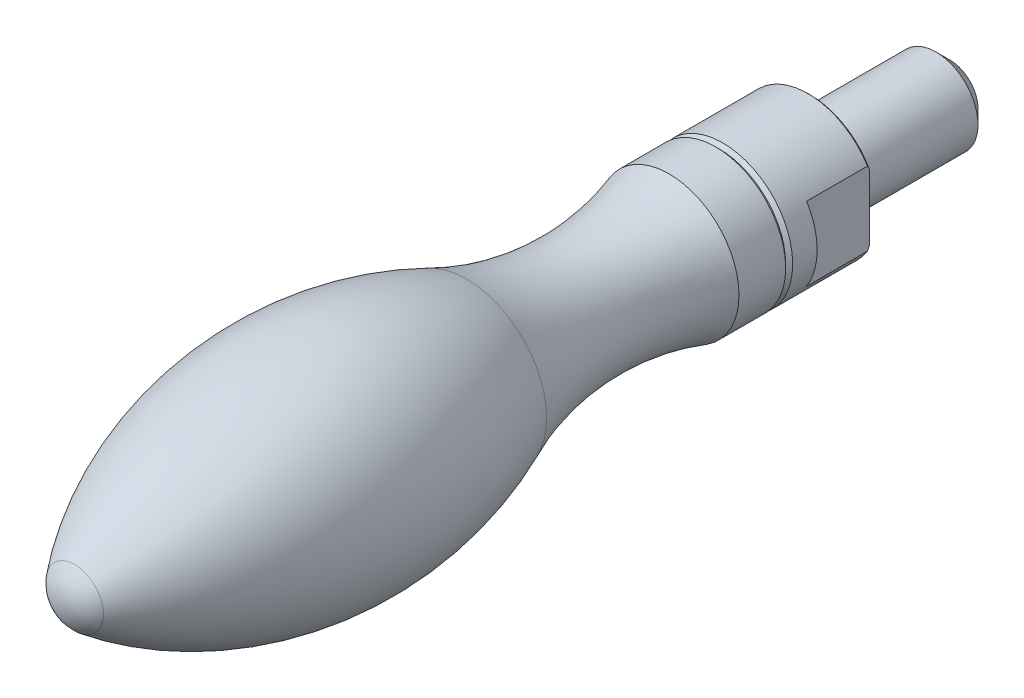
ISO-10303-21;
HEADER;
FILE_DESCRIPTION(('STEP AP214'),'2;1');
FILE_NAME('part.step','',(''),(''),'','','');
FILE_SCHEMA(('AUTOMOTIVE_DESIGN { 1 0 10303 214 1 1 1 1 }'));
ENDSEC;
DATA;
#1=APPLICATION_CONTEXT('core data for automotive mechanical design processes');
#2=APPLICATION_PROTOCOL_DEFINITION('international standard','automotive_design',2000,#1);
#3=PRODUCT_CONTEXT('',#1,'mechanical');
#4=PRODUCT('Part','Part','',(#3));
#5=PRODUCT_RELATED_PRODUCT_CATEGORY('part','',(#4));
#6=PRODUCT_DEFINITION_FORMATION('','',#4);
#7=PRODUCT_DEFINITION_CONTEXT('part definition',#1,'design');
#8=PRODUCT_DEFINITION('design','',#6,#7);
#9=PRODUCT_DEFINITION_SHAPE('','',#8);
#10=(LENGTH_UNIT() NAMED_UNIT(*) SI_UNIT(.MILLI.,.METRE.));
#11=(NAMED_UNIT(*) PLANE_ANGLE_UNIT() SI_UNIT($,.RADIAN.));
#12=(NAMED_UNIT(*) SI_UNIT($,.STERADIAN.) SOLID_ANGLE_UNIT());
#13=UNCERTAINTY_MEASURE_WITH_UNIT(LENGTH_MEASURE(1.E-05),#10,'distance_accuracy_value','');
#14=(GEOMETRIC_REPRESENTATION_CONTEXT(3) GLOBAL_UNCERTAINTY_ASSIGNED_CONTEXT((#13)) GLOBAL_UNIT_ASSIGNED_CONTEXT((#10,
#11,#12)) REPRESENTATION_CONTEXT('',''));
#15=CARTESIAN_POINT('',(0.,0.,0.));
#16=DIRECTION('',(0.,0.,1.));
#17=DIRECTION('',(1.,0.,0.));
#18=AXIS2_PLACEMENT_3D('',#15,#16,#17);
#19=CARTESIAN_POINT('',(0.,0.,-25.0000000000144));
#20=DIRECTION('',(0.,0.,-1.));
#21=DIRECTION('',(1.,0.,0.));
#22=AXIS2_PLACEMENT_3D('',#19,#20,#21);
#23=CYLINDRICAL_SURFACE('',#22,10.);
#24=CARTESIAN_POINT('',(0.,0.,12.5));
#25=DIRECTION('',(0.,0.,-1.));
#26=DIRECTION('',(1.,0.,0.));
#27=AXIS2_PLACEMENT_3D('',#24,#25,#26);
#28=CIRCLE('',#27,10.);
#29=CARTESIAN_POINT('',(10.,0.,12.5));
#30=VERTEX_POINT('',#29);
#31=EDGE_CURVE('E119',#30,#30,#28,.T.);
#32=ORIENTED_EDGE('',*,*,#31,.T.);
#33=EDGE_LOOP('',(#32));
#34=FACE_BOUND('',#33,.T.);
#35=CARTESIAN_POINT('',(0.,0.,0.299999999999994));
#36=DIRECTION('',(0.,0.,-1.));
#37=DIRECTION('',(1.,0.,0.));
#38=AXIS2_PLACEMENT_3D('',#35,#36,#37);
#39=CIRCLE('',#38,10.);
#40=CARTESIAN_POINT('',(8.5,-5.26782687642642,0.299999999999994));
#41=VERTEX_POINT('',#40);
#42=CARTESIAN_POINT('',(-8.5,-5.26782687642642,0.299999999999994));
#43=VERTEX_POINT('',#42);
#44=EDGE_CURVE('E124',#41,#43,#39,.T.);
#45=ORIENTED_EDGE('',*,*,#44,.F.);
#46=DIRECTION('',(0.,0.,-1.));
#47=VECTOR('',#46,1.);
#48=CARTESIAN_POINT('',(8.5,-5.2678268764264,-25.0000000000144));
#49=LINE('',#48,#47);
#50=CARTESIAN_POINT('',(8.5,-5.26782687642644,9.));
#51=VERTEX_POINT('',#50);
#52=EDGE_CURVE('E78',#41,#51,#49,.F.);
#53=ORIENTED_EDGE('',*,*,#52,.T.);
#54=CARTESIAN_POINT('',(0.,0.,9.));
#55=DIRECTION('',(0.,0.,1.));
#56=DIRECTION('',(0.,1.,0.));
#57=AXIS2_PLACEMENT_3D('',#54,#55,#56);
#58=CIRCLE('',#57,10.);
#59=CARTESIAN_POINT('',(8.5,5.26782687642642,9.));
#60=VERTEX_POINT('',#59);
#61=EDGE_CURVE('E82',#60,#51,#58,.F.);
#62=ORIENTED_EDGE('',*,*,#61,.F.);
#63=DIRECTION('',(0.,0.,-1.));
#64=VECTOR('',#63,1.);
#65=CARTESIAN_POINT('',(8.5,5.26782687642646,-25.0000000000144));
#66=LINE('',#65,#64);
#67=CARTESIAN_POINT('',(8.5,5.26782687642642,0.299999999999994));
#68=VERTEX_POINT('',#67);
#69=EDGE_CURVE('E67',#60,#68,#66,.T.);
#70=ORIENTED_EDGE('',*,*,#69,.T.);
#71=CARTESIAN_POINT('',(-8.5,5.26782687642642,0.299999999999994));
#72=VERTEX_POINT('',#71);
#73=EDGE_CURVE('E122',#72,#68,#39,.T.);
#74=ORIENTED_EDGE('',*,*,#73,.F.);
#75=DIRECTION('',(0.,0.,-1.));
#76=VECTOR('',#75,1.);
#77=CARTESIAN_POINT('',(-8.5,5.26782687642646,-25.0000000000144));
#78=LINE('',#77,#76);
#79=CARTESIAN_POINT('',(-8.5,5.26782687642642,9.));
#80=VERTEX_POINT('',#79);
#81=EDGE_CURVE('E134',#80,#72,#78,.T.);
#82=ORIENTED_EDGE('',*,*,#81,.F.);
#83=CARTESIAN_POINT('',(0.,0.,9.));
#84=DIRECTION('',(0.,0.,-1.));
#85=DIRECTION('',(0.,-1.,0.));
#86=AXIS2_PLACEMENT_3D('',#83,#84,#85);
#87=CIRCLE('',#86,10.);
#88=CARTESIAN_POINT('',(-8.5,-5.26782687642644,9.));
#89=VERTEX_POINT('',#88);
#90=EDGE_CURVE('E88',#80,#89,#87,.F.);
#91=ORIENTED_EDGE('',*,*,#90,.T.);
#92=DIRECTION('',(0.,0.,-1.));
#93=VECTOR('',#92,1.);
#94=CARTESIAN_POINT('',(-8.5,-5.2678268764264,-25.0000000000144));
#95=LINE('',#94,#93);
#96=EDGE_CURVE('E132',#43,#89,#95,.F.);
#97=ORIENTED_EDGE('',*,*,#96,.F.);
#98=EDGE_LOOP('',(#45,#53,#62,#70,#74,#82,#91,#97));
#99=FACE_BOUND('',#98,.T.);
#100=ADVANCED_FACE('F14',(#34,#99),#23,.T.);
#101=CARTESIAN_POINT('',(0.,0.,0.299999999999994));
#102=DIRECTION('',(0.,0.,1.));
#103=DIRECTION('',(-1.,0.,0.));
#104=AXIS2_PLACEMENT_3D('',#101,#102,#103);
#105=CONICAL_SURFACE('',#104,10.,0.785398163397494);
#106=CARTESIAN_POINT('',(8.5,2.56867166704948,-0.820356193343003));
#107=CARTESIAN_POINT('',(8.5,2.75838064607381,-0.76547544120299));
#108=CARTESIAN_POINT('',(8.5,2.9465455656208,-0.705474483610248));
#109=CARTESIAN_POINT('',(8.5,3.31963410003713,-0.576440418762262));
#110=CARTESIAN_POINT('',(8.5,3.50455961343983,-0.507412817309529));
#111=CARTESIAN_POINT('',(8.5,3.87068532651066,-0.361687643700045));
#112=CARTESIAN_POINT('',(8.5,4.05189519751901,-0.285014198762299));
#113=CARTESIAN_POINT('',(8.5,4.41129219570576,-0.12484254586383));
#114=CARTESIAN_POINT('',(8.5,4.58947880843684,-0.0413431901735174));
#115=CARTESIAN_POINT('',(8.5,5.11714030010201,0.216714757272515));
#116=CARTESIAN_POINT('',(8.5,5.4624000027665,0.399931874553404));
#117=CARTESIAN_POINT('',(8.5,5.97296463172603,0.687811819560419));
#118=CARTESIAN_POINT('',(8.5,6.14201017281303,0.785997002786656));
#119=CARTESIAN_POINT('',(8.5,6.4778456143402,0.986172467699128));
#120=CARTESIAN_POINT('',(8.5,6.64463547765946,1.08816281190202));
#121=CARTESIAN_POINT('',(8.5,7.03507901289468,1.3322970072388));
#122=CARTESIAN_POINT('',(8.5,7.25786593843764,1.47582435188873));
#123=CARTESIAN_POINT('',(8.5,7.70009623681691,1.76795255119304));
#124=CARTESIAN_POINT('',(8.5,7.91953941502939,1.91655369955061));
#125=CARTESIAN_POINT('',(8.5,8.35552106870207,2.21805047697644));
#126=CARTESIAN_POINT('',(8.5,8.57205889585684,2.37094704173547));
#127=CARTESIAN_POINT('',(8.5,9.00253635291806,2.68035963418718));
#128=CARTESIAN_POINT('',(8.5,9.21647590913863,2.83687576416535));
#129=CARTESIAN_POINT('',(8.5,9.85528209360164,3.31133974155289));
#130=CARTESIAN_POINT('',(8.5,10.2767167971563,3.63391005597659));
#131=CARTESIAN_POINT('',(8.5,11.1124438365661,4.2881724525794));
#132=CARTESIAN_POINT('',(8.5,11.5267357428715,4.61986508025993));
#133=CARTESIAN_POINT('',(8.5,12.148266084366,5.12617959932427));
#134=CARTESIAN_POINT('',(8.5,12.3576088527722,5.29822775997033));
#135=CARTESIAN_POINT('',(8.5,12.77495932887,5.64392086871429));
#136=CARTESIAN_POINT('',(8.5,12.9829670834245,5.81756576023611));
#137=CARTESIAN_POINT('',(8.5,13.6052392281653,6.34063468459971));
#138=CARTESIAN_POINT('',(8.5,14.0177275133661,6.69217253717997));
#139=CARTESIAN_POINT('',(8.5,14.8374371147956,7.39843100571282));
#140=CARTESIAN_POINT('',(8.5,15.2446718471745,7.75313609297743));
#141=CARTESIAN_POINT('',(8.5,16.0559512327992,8.46608631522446));
#142=CARTESIAN_POINT('',(8.5,16.4599962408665,8.82433104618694));
#143=CARTESIAN_POINT('',(8.5,16.8627957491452,9.1839582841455));
#144=B_SPLINE_CURVE_WITH_KNOTS('',3,(#106,#107,#108,#109,#110,#111,#112,#113,#114,#115,#116,
#117,#118,#119,#120,#121,#122,#123,#124,#125,#126,#127,#128,#129,#130,#131,#132,#133,#134,#135,
#136,#137,#138,#139,#140,#141,#142,#143),.UNSPECIFIED.,.F.,.F.,(4,2,2,2,2,2,2,2,2,2,2,2,2,2,2,2,
2,2,4),(0.,0.592302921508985,1.18424623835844,1.77437742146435,2.36460803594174,3.5363898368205,
4.12283527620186,4.70929035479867,5.50425762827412,6.29927099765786,7.09445891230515,
7.88966932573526,9.48162463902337,11.0736753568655,11.8865796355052,12.699455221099,
14.3253032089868,15.9454369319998,17.565387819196),.UNSPECIFIED.);
#145=CARTESIAN_POINT('',(8.5,4.67332857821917,0.));
#146=VERTEX_POINT('',#145);
#147=EDGE_CURVE('E73',#146,#68,#144,.T.);
#148=ORIENTED_EDGE('',*,*,#147,.F.);
#149=CARTESIAN_POINT('',(0.,0.,0.));
#150=DIRECTION('',(0.,0.,-1.));
#151=DIRECTION('',(1.,0.,0.));
#152=AXIS2_PLACEMENT_3D('',#149,#150,#151);
#153=CIRCLE('',#152,9.7);
#154=CARTESIAN_POINT('',(-8.5,4.67332857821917,0.));
#155=VERTEX_POINT('',#154);
#156=EDGE_CURVE('E125',#155,#146,#153,.T.);
#157=ORIENTED_EDGE('',*,*,#156,.F.);
#158=CARTESIAN_POINT('',(-8.5,2.56867166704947,-0.820356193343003));
#159=CARTESIAN_POINT('',(-8.5,2.7583806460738,-0.765475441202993));
#160=CARTESIAN_POINT('',(-8.5,2.94654556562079,-0.705474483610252));
#161=CARTESIAN_POINT('',(-8.5,3.31963410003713,-0.576440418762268));
#162=CARTESIAN_POINT('',(-8.5,3.50455961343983,-0.507412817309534));
#163=CARTESIAN_POINT('',(-8.5,3.87068532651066,-0.36168764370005));
#164=CARTESIAN_POINT('',(-8.5,4.05189519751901,-0.285014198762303));
#165=CARTESIAN_POINT('',(-8.5,4.41129219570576,-0.124842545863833));
#166=CARTESIAN_POINT('',(-8.5,4.58947880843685,-0.0413431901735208));
#167=CARTESIAN_POINT('',(-8.5,5.11714030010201,0.216714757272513));
#168=CARTESIAN_POINT('',(-8.5,5.4624000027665,0.399931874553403));
#169=CARTESIAN_POINT('',(-8.5,5.97296463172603,0.687811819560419));
#170=CARTESIAN_POINT('',(-8.5,6.14201017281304,0.785997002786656));
#171=CARTESIAN_POINT('',(-8.5,6.47784561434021,0.986172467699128));
#172=CARTESIAN_POINT('',(-8.5,6.64463547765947,1.08816281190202));
#173=CARTESIAN_POINT('',(-8.5,7.03507901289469,1.3322970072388));
#174=CARTESIAN_POINT('',(-8.5,7.25786593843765,1.47582435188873));
#175=CARTESIAN_POINT('',(-8.5,7.70009623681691,1.76795255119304));
#176=CARTESIAN_POINT('',(-8.5,7.91953941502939,1.91655369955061));
#177=CARTESIAN_POINT('',(-8.5,8.35552106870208,2.21805047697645));
#178=CARTESIAN_POINT('',(-8.5,8.57205889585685,2.37094704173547));
#179=CARTESIAN_POINT('',(-8.5,9.00253635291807,2.68035963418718));
#180=CARTESIAN_POINT('',(-8.5,9.21647590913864,2.83687576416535));
#181=CARTESIAN_POINT('',(-8.5,9.85528209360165,3.31133974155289));
#182=CARTESIAN_POINT('',(-8.5,10.2767167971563,3.63391005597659));
#183=CARTESIAN_POINT('',(-8.5,11.1124438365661,4.2881724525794));
#184=CARTESIAN_POINT('',(-8.5,11.5267357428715,4.61986508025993));
#185=CARTESIAN_POINT('',(-8.5,12.148266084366,5.12617959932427));
#186=CARTESIAN_POINT('',(-8.5,12.3576088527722,5.29822775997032));
#187=CARTESIAN_POINT('',(-8.5,12.77495932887,5.64392086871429));
#188=CARTESIAN_POINT('',(-8.5,12.9829670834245,5.8175657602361));
#189=CARTESIAN_POINT('',(-8.5,13.6052392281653,6.34063468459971));
#190=CARTESIAN_POINT('',(-8.5,14.0177275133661,6.69217253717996));
#191=CARTESIAN_POINT('',(-8.5,14.8374371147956,7.39843100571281));
#192=CARTESIAN_POINT('',(-8.5,15.2446718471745,7.75313609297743));
#193=CARTESIAN_POINT('',(-8.5,16.0559512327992,8.46608631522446));
#194=CARTESIAN_POINT('',(-8.5,16.4599962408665,8.82433104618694));
#195=CARTESIAN_POINT('',(-8.5,16.8627957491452,9.1839582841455));
#196=B_SPLINE_CURVE_WITH_KNOTS('',3,(#158,#159,#160,#161,#162,#163,#164,#165,#166,#167,#168,
#169,#170,#171,#172,#173,#174,#175,#176,#177,#178,#179,#180,#181,#182,#183,#184,#185,#186,#187,
#188,#189,#190,#191,#192,#193,#194,#195),.UNSPECIFIED.,.F.,.F.,(4,2,2,2,2,2,2,2,2,2,2,2,2,2,2,2,
2,2,4),(0.,0.592302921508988,1.18424623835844,1.77437742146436,2.36460803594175,
3.53638983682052,4.12283527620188,4.70929035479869,5.50425762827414,6.29927099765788,
7.09445891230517,7.88966932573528,9.48162463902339,11.0736753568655,11.8865796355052,
12.699455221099,14.3253032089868,15.9454369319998,17.565387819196),.UNSPECIFIED.);
#197=EDGE_CURVE('E37',#155,#72,#196,.T.);
#198=ORIENTED_EDGE('',*,*,#197,.T.);
#199=ORIENTED_EDGE('',*,*,#73,.T.);
#200=EDGE_LOOP('',(#148,#157,#198,#199));
#201=FACE_BOUND('',#200,.T.);
#202=ADVANCED_FACE('F149',(#201),#105,.T.);
#203=CARTESIAN_POINT('',(8.5,-8.10616511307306,2.04563377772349));
#204=CARTESIAN_POINT('',(8.5,-7.89541017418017,1.90021860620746));
#205=CARTESIAN_POINT('',(8.5,-7.68328150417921,1.75675655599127));
#206=CARTESIAN_POINT('',(8.5,-7.25580100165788,1.47455330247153));
#207=CARTESIAN_POINT('',(8.5,-7.04044803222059,1.33581382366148));
#208=CARTESIAN_POINT('',(8.5,-6.60462424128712,1.06299340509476));
#209=CARTESIAN_POINT('',(8.5,-6.38412766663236,0.928953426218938));
#210=CARTESIAN_POINT('',(8.5,-5.9391115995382,0.667765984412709));
#211=CARTESIAN_POINT('',(8.5,-5.71459254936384,0.540617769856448));
#212=CARTESIAN_POINT('',(8.5,-5.26926589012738,0.299073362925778));
#213=CARTESIAN_POINT('',(8.5,-5.04862000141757,0.184381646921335));
#214=CARTESIAN_POINT('',(8.5,-4.60277091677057,-0.0357411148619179));
#215=CARTESIAN_POINT('',(8.5,-4.37756722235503,-0.141171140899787));
#216=CARTESIAN_POINT('',(8.5,-3.69577783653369,-0.440286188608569));
#217=CARTESIAN_POINT('',(8.5,-3.23157106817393,-0.617604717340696));
#218=CARTESIAN_POINT('',(8.5,-2.54851206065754,-0.828398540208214));
#219=CARTESIAN_POINT('',(8.5,-2.3372877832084,-0.886928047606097));
#220=CARTESIAN_POINT('',(8.5,-1.9114557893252,-0.990177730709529));
#221=CARTESIAN_POINT('',(8.5,-1.69684824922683,-1.03489862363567));
#222=CARTESIAN_POINT('',(8.5,-1.26167378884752,-1.10958504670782));
#223=CARTESIAN_POINT('',(8.5,-1.04106586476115,-1.13931608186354));
#224=CARTESIAN_POINT('',(8.5,-0.708852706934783,-1.17120892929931));
#225=CARTESIAN_POINT('',(8.5,-0.597830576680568,-1.17972389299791));
#226=CARTESIAN_POINT('',(8.5,-0.375528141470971,-1.19243340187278));
#227=CARTESIAN_POINT('',(8.5,-0.264247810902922,-1.19662749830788));
#228=CARTESIAN_POINT('',(8.5,-0.152915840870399,-1.19862462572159));
#229=B_SPLINE_CURVE_WITH_KNOTS('',3,(#203,#204,#205,#206,#207,#208,#209,#210,#211,#212,#213,
#214,#215,#216,#217,#218,#219,#220,#221,#222,#223,#224,#225,#226,#227,#228),.UNSPECIFIED.,.F.,
.F.,(4,2,2,2,2,2,2,2,2,2,2,2,4),(0.,0.768180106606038,1.53663777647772,2.31065454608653,
3.08458672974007,3.83038837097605,4.57627202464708,6.06309227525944,6.72027493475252,
7.37742345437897,8.04455578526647,8.37852611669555,8.71253112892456),.UNSPECIFIED.);
#230=CARTESIAN_POINT('',(8.5,-4.67332857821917,0.));
#231=VERTEX_POINT('',#230);
#232=EDGE_CURVE('E29',#41,#231,#229,.T.);
#233=ORIENTED_EDGE('',*,*,#232,.F.);
#234=ORIENTED_EDGE('',*,*,#44,.T.);
#235=CARTESIAN_POINT('',(-8.5,-8.10616511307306,2.04563377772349));
#236=CARTESIAN_POINT('',(-8.5,-7.89541017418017,1.90021860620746));
#237=CARTESIAN_POINT('',(-8.5,-7.68328150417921,1.75675655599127));
#238=CARTESIAN_POINT('',(-8.5,-7.25580100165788,1.47455330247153));
#239=CARTESIAN_POINT('',(-8.5,-7.04044803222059,1.33581382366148));
#240=CARTESIAN_POINT('',(-8.5,-6.60462424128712,1.06299340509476));
#241=CARTESIAN_POINT('',(-8.5,-6.38412766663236,0.928953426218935));
#242=CARTESIAN_POINT('',(-8.5,-5.93911159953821,0.667765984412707));
#243=CARTESIAN_POINT('',(-8.5,-5.71459254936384,0.540617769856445));
#244=CARTESIAN_POINT('',(-8.5,-5.26926589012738,0.299073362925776));
#245=CARTESIAN_POINT('',(-8.5,-5.04862000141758,0.184381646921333));
#246=CARTESIAN_POINT('',(-8.5,-4.60277091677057,-0.0357411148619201));
#247=CARTESIAN_POINT('',(-8.5,-4.37756722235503,-0.14117114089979));
#248=CARTESIAN_POINT('',(-8.5,-3.69577783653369,-0.440286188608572));
#249=CARTESIAN_POINT('',(-8.5,-3.23157106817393,-0.617604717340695));
#250=CARTESIAN_POINT('',(-8.5,-2.54851206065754,-0.828398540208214));
#251=CARTESIAN_POINT('',(-8.5,-2.3372877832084,-0.886928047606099));
#252=CARTESIAN_POINT('',(-8.5,-1.91145578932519,-0.990177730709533));
#253=CARTESIAN_POINT('',(-8.5,-1.69684824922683,-1.03489862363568));
#254=CARTESIAN_POINT('',(-8.5,-1.26167378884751,-1.10958504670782));
#255=CARTESIAN_POINT('',(-8.5,-1.04106586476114,-1.13931608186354));
#256=CARTESIAN_POINT('',(-8.5,-0.708852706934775,-1.17120892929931));
#257=CARTESIAN_POINT('',(-8.5,-0.59783057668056,-1.17972389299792));
#258=CARTESIAN_POINT('',(-8.5,-0.375528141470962,-1.19243340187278));
#259=CARTESIAN_POINT('',(-8.5,-0.264247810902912,-1.19662749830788));
#260=CARTESIAN_POINT('',(-8.5,-0.152915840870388,-1.19862462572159));
#261=B_SPLINE_CURVE_WITH_KNOTS('',3,(#235,#236,#237,#238,#239,#240,#241,#242,#243,#244,#245,
#246,#247,#248,#249,#250,#251,#252,#253,#254,#255,#256,#257,#258,#259,#260),.UNSPECIFIED.,.F.,
.F.,(4,2,2,2,2,2,2,2,2,2,2,2,4),(0.,0.768180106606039,1.53663777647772,2.31065454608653,
3.08458672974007,3.83038837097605,4.57627202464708,6.06309227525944,6.72027493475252,
7.37742345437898,8.04455578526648,8.37852611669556,8.71253112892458),.UNSPECIFIED.);
#262=CARTESIAN_POINT('',(-8.5,-4.67332857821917,0.));
#263=VERTEX_POINT('',#262);
#264=EDGE_CURVE('E143',#43,#263,#261,.T.);
#265=ORIENTED_EDGE('',*,*,#264,.T.);
#266=EDGE_CURVE('E128',#231,#263,#153,.T.);
#267=ORIENTED_EDGE('',*,*,#266,.F.);
#268=EDGE_LOOP('',(#233,#234,#265,#267));
#269=FACE_BOUND('',#268,.T.);
#270=ADVANCED_FACE('F172',(#269),#105,.T.);
#271=CARTESIAN_POINT('',(-9.70000000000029,0.,0.));
#272=DIRECTION('',(0.,0.,1.));
#273=DIRECTION('',(-1.,0.,0.));
#274=AXIS2_PLACEMENT_3D('',#271,#272,#273);
#275=PLANE('',#274);
#276=CARTESIAN_POINT('',(0.,0.,0.));
#277=DIRECTION('',(0.,0.,-1.));
#278=DIRECTION('',(1.,0.,0.));
#279=AXIS2_PLACEMENT_3D('',#276,#277,#278);
#280=CIRCLE('',#279,6.);
#281=CARTESIAN_POINT('',(6.,0.,0.));
#282=VERTEX_POINT('',#281);
#283=EDGE_CURVE('E129',#282,#282,#280,.T.);
#284=ORIENTED_EDGE('',*,*,#283,.F.);
#285=EDGE_LOOP('',(#284));
#286=FACE_BOUND('',#285,.T.);
#287=DIRECTION('',(0.,1.,0.));
#288=VECTOR('',#287,1.);
#289=CARTESIAN_POINT('',(8.5,0.,0.));
#290=LINE('',#289,#288);
#291=EDGE_CURVE('E85',#231,#146,#290,.T.);
#292=ORIENTED_EDGE('',*,*,#291,.F.);
#293=ORIENTED_EDGE('',*,*,#266,.T.);
#294=DIRECTION('',(0.,1.,0.));
#295=VECTOR('',#294,1.);
#296=CARTESIAN_POINT('',(-8.5,0.,0.));
#297=LINE('',#296,#295);
#298=EDGE_CURVE('E93',#263,#155,#297,.T.);
#299=ORIENTED_EDGE('',*,*,#298,.T.);
#300=ORIENTED_EDGE('',*,*,#156,.T.);
#301=EDGE_LOOP('',(#292,#293,#299,#300));
#302=FACE_BOUND('',#301,.T.);
#303=ADVANCED_FACE('F169',(#286,#302),#275,.F.);
#304=CARTESIAN_POINT('',(-6.,0.,-20.0000000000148));
#305=DIRECTION('',(0.,0.,1.));
#306=DIRECTION('',(-1.,0.,0.));
#307=AXIS2_PLACEMENT_3D('',#304,#305,#306);
#308=PLANE('',#307);
#309=CARTESIAN_POINT('',(0.,0.,-20.0000000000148));
#310=DIRECTION('',(0.,0.,1.));
#311=DIRECTION('',(0.,-1.,0.));
#312=AXIS2_PLACEMENT_3D('',#309,#310,#311);
#313=CIRCLE('',#312,4.);
#314=CARTESIAN_POINT('',(0.,-3.99999999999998,-20.0000000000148));
#315=VERTEX_POINT('',#314);
#316=EDGE_CURVE('E22',#315,#315,#313,.F.);
#317=ORIENTED_EDGE('',*,*,#316,.T.);
#318=EDGE_LOOP('',(#317));
#319=FACE_BOUND('',#318,.T.);
#320=ADVANCED_FACE('F171',(#319),#308,.F.);
#321=CARTESIAN_POINT('',(0.,-1.11311423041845E-13,101.5));
#322=DIRECTION('',(0.,-1.,0.));
#323=DIRECTION('',(0.,0.,1.));
#324=AXIS2_PLACEMENT_3D('',#321,#322,#323);
#325=SPHERICAL_SURFACE('',#324,5.5);
#326=CARTESIAN_POINT('',(0.,-1.11311423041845E-13,101.5));
#327=DIRECTION('',(0.,0.,-1.));
#328=DIRECTION('',(1.,0.,0.));
#329=AXIS2_PLACEMENT_3D('',#326,#327,#328);
#330=SPHERICAL_SURFACE('',#329,5.5);
#331=CARTESIAN_POINT('',(0.,-1.15322900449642E-13,105.157890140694));
#332=DIRECTION('',(0.,0.,-1.));
#333=DIRECTION('',(1.,0.,0.));
#334=AXIS2_PLACEMENT_3D('',#331,#332,#333);
#335=CIRCLE('',#334,4.10729104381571);
#336=CARTESIAN_POINT('',(4.10729104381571,-1.15322900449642E-13,105.157890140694));
#337=VERTEX_POINT('',#336);
#338=EDGE_CURVE('E95',#337,#337,#335,.T.);
#339=ORIENTED_EDGE('',*,*,#338,.F.);
#340=EDGE_LOOP('',(#339));
#341=FACE_BOUND('',#340,.T.);
#342=ADVANCED_FACE('F180',(#341),#330,.T.);
#343=CARTESIAN_POINT('',(0.,0.,71.));
#344=DIRECTION('',(0.,0.,-1.));
#345=DIRECTION('',(1.,0.,0.));
#346=AXIS2_PLACEMENT_3D('',#343,#344,#345);
#347=DEGENERATE_TOROIDAL_SURFACE('',#346,39.,55.,.F.);
#348=CARTESIAN_POINT('',(0.,0.,49.1534009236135));
#349=DIRECTION('',(0.,0.,-1.));
#350=DIRECTION('',(1.,0.,0.));
#351=AXIS2_PLACEMENT_3D('',#348,#349,#350);
#352=CIRCLE('',#351,11.475004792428);
#353=CARTESIAN_POINT('',(11.475004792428,0.,49.1534009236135));
#354=VERTEX_POINT('',#353);
#355=EDGE_CURVE('E98',#354,#354,#352,.T.);
#356=ORIENTED_EDGE('',*,*,#355,.F.);
#357=EDGE_LOOP('',(#356));
#358=FACE_BOUND('',#357,.T.);
#359=ORIENTED_EDGE('',*,*,#338,.T.);
#360=EDGE_LOOP('',(#359));
#361=FACE_BOUND('',#360,.T.);
#362=ADVANCED_FACE('F219',(#358,#361),#347,.F.);
#363=CARTESIAN_POINT('',(0.,0.,32.74));
#364=DIRECTION('',(0.,0.,-1.));
#365=DIRECTION('',(1.,0.,0.));
#366=AXIS2_PLACEMENT_3D('',#363,#364,#365);
#367=TOROIDAL_SURFACE('',#366,48.5,40.5);
#368=ORIENTED_EDGE('',*,*,#355,.T.);
#369=EDGE_LOOP('',(#368));
#370=FACE_BOUND('',#369,.T.);
#371=CARTESIAN_POINT('',(0.,0.,20.1701949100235));
#372=DIRECTION('',(0.,0.,-1.));
#373=DIRECTION('',(1.,0.,0.));
#374=AXIS2_PLACEMENT_3D('',#371,#372,#373);
#375=CIRCLE('',#374,9.99999999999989);
#376=CARTESIAN_POINT('',(9.99999999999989,0.,20.1701949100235));
#377=VERTEX_POINT('',#376);
#378=EDGE_CURVE('E101',#377,#377,#375,.T.);
#379=ORIENTED_EDGE('',*,*,#378,.F.);
#380=EDGE_LOOP('',(#379));
#381=FACE_BOUND('',#380,.T.);
#382=ADVANCED_FACE('F215',(#370,#381),#367,.F.);
#383=CARTESIAN_POINT('',(0.,0.,-25.0000000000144));
#384=DIRECTION('',(0.,0.,-1.));
#385=DIRECTION('',(1.,0.,0.));
#386=AXIS2_PLACEMENT_3D('',#383,#384,#385);
#387=CYLINDRICAL_SURFACE('',#386,10.);
#388=ORIENTED_EDGE('',*,*,#378,.T.);
#389=EDGE_LOOP('',(#388));
#390=FACE_BOUND('',#389,.T.);
#391=CARTESIAN_POINT('',(0.,0.,13.5));
#392=DIRECTION('',(0.,0.,-1.));
#393=DIRECTION('',(1.,0.,0.));
#394=AXIS2_PLACEMENT_3D('',#391,#392,#393);
#395=CIRCLE('',#394,10.);
#396=CARTESIAN_POINT('',(10.,0.,13.5));
#397=VERTEX_POINT('',#396);
#398=EDGE_CURVE('E104',#397,#397,#395,.T.);
#399=ORIENTED_EDGE('',*,*,#398,.F.);
#400=EDGE_LOOP('',(#399));
#401=FACE_BOUND('',#400,.T.);
#402=ADVANCED_FACE('F211',(#390,#401),#387,.T.);
#403=CARTESIAN_POINT('',(-10.0000000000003,0.,13.5));
#404=DIRECTION('',(0.,0.,1.));
#405=DIRECTION('',(-1.,0.,0.));
#406=AXIS2_PLACEMENT_3D('',#403,#404,#405);
#407=PLANE('',#406);
#408=CARTESIAN_POINT('',(0.,0.,13.5));
#409=DIRECTION('',(0.,0.,-1.));
#410=DIRECTION('',(1.,0.,0.));
#411=AXIS2_PLACEMENT_3D('',#408,#409,#410);
#412=CIRCLE('',#411,4.95000000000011);
#413=CARTESIAN_POINT('',(4.95000000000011,0.,13.5));
#414=VERTEX_POINT('',#413);
#415=EDGE_CURVE('E107',#414,#414,#412,.T.);
#416=ORIENTED_EDGE('',*,*,#415,.F.);
#417=EDGE_LOOP('',(#416));
#418=FACE_BOUND('',#417,.T.);
#419=ORIENTED_EDGE('',*,*,#398,.T.);
#420=EDGE_LOOP('',(#419));
#421=FACE_BOUND('',#420,.T.);
#422=ADVANCED_FACE('F207',(#418,#421),#407,.F.);
#423=CARTESIAN_POINT('',(0.,0.,-25.0000000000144));
#424=DIRECTION('',(0.,0.,-1.));
#425=DIRECTION('',(1.,0.,0.));
#426=AXIS2_PLACEMENT_3D('',#423,#424,#425);
#427=CYLINDRICAL_SURFACE('',#426,4.95000000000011);
#428=ORIENTED_EDGE('',*,*,#415,.T.);
#429=EDGE_LOOP('',(#428));
#430=FACE_BOUND('',#429,.T.);
#431=CARTESIAN_POINT('',(0.,0.,13.4));
#432=DIRECTION('',(0.,0.,-1.));
#433=DIRECTION('',(1.,0.,0.));
#434=AXIS2_PLACEMENT_3D('',#431,#432,#433);
#435=CIRCLE('',#434,4.95000000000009);
#436=CARTESIAN_POINT('',(4.95000000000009,0.,13.4));
#437=VERTEX_POINT('',#436);
#438=EDGE_CURVE('E110',#437,#437,#435,.T.);
#439=ORIENTED_EDGE('',*,*,#438,.F.);
#440=EDGE_LOOP('',(#439));
#441=FACE_BOUND('',#440,.T.);
#442=ADVANCED_FACE('F203',(#430,#441),#427,.T.);
#443=CARTESIAN_POINT('',(0.,0.,13.4));
#444=DIRECTION('',(0.,0.,-1.));
#445=DIRECTION('',(1.,0.,0.));
#446=AXIS2_PLACEMENT_3D('',#443,#444,#445);
#447=TOROIDAL_SURFACE('',#446,5.35000000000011,0.400000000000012);
#448=ORIENTED_EDGE('',*,*,#438,.T.);
#449=EDGE_LOOP('',(#448));
#450=FACE_BOUND('',#449,.T.);
#451=CARTESIAN_POINT('',(0.,0.,13.));
#452=DIRECTION('',(0.,0.,-1.));
#453=DIRECTION('',(1.,0.,0.));
#454=AXIS2_PLACEMENT_3D('',#451,#452,#453);
#455=CIRCLE('',#454,5.3500000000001);
#456=CARTESIAN_POINT('',(5.3500000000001,0.,13.));
#457=VERTEX_POINT('',#456);
#458=EDGE_CURVE('E113',#457,#457,#455,.T.);
#459=ORIENTED_EDGE('',*,*,#458,.F.);
#460=EDGE_LOOP('',(#459));
#461=FACE_BOUND('',#460,.T.);
#462=ADVANCED_FACE('F199',(#450,#461),#447,.F.);
#463=CARTESIAN_POINT('',(-9.50000000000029,0.,13.));
#464=DIRECTION('',(0.,0.,1.));
#465=DIRECTION('',(-1.,0.,0.));
#466=AXIS2_PLACEMENT_3D('',#463,#464,#465);
#467=PLANE('',#466);
#468=ORIENTED_EDGE('',*,*,#458,.T.);
#469=EDGE_LOOP('',(#468));
#470=FACE_BOUND('',#469,.T.);
#471=CARTESIAN_POINT('',(0.,0.,13.));
#472=DIRECTION('',(0.,0.,-1.));
#473=DIRECTION('',(1.,0.,0.));
#474=AXIS2_PLACEMENT_3D('',#471,#472,#473);
#475=CIRCLE('',#474,9.5);
#476=CARTESIAN_POINT('',(9.5,0.,13.));
#477=VERTEX_POINT('',#476);
#478=EDGE_CURVE('E116',#477,#477,#475,.T.);
#479=ORIENTED_EDGE('',*,*,#478,.F.);
#480=EDGE_LOOP('',(#479));
#481=FACE_BOUND('',#480,.T.);
#482=ADVANCED_FACE('F195',(#470,#481),#467,.T.);
#483=CARTESIAN_POINT('',(0.,0.,12.5));
#484=DIRECTION('',(0.,0.,-1.));
#485=DIRECTION('',(1.,0.,0.));
#486=AXIS2_PLACEMENT_3D('',#483,#484,#485);
#487=CONICAL_SURFACE('',#486,10.,0.785398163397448);
#488=ORIENTED_EDGE('',*,*,#478,.T.);
#489=EDGE_LOOP('',(#488));
#490=FACE_BOUND('',#489,.T.);
#491=ORIENTED_EDGE('',*,*,#31,.F.);
#492=EDGE_LOOP('',(#491));
#493=FACE_BOUND('',#492,.T.);
#494=ADVANCED_FACE('F167',(#490,#493),#487,.T.);
#495=CARTESIAN_POINT('',(0.,0.,-25.0000000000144));
#496=DIRECTION('',(0.,0.,-1.));
#497=DIRECTION('',(1.,0.,0.));
#498=AXIS2_PLACEMENT_3D('',#495,#496,#497);
#499=CYLINDRICAL_SURFACE('',#498,6.);
#500=CARTESIAN_POINT('',(0.,0.,-18.0000000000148));
#501=DIRECTION('',(0.,0.,1.));
#502=DIRECTION('',(0.,-1.,0.));
#503=AXIS2_PLACEMENT_3D('',#500,#501,#502);
#504=CIRCLE('',#503,6.);
#505=CARTESIAN_POINT('',(0.,-5.99999999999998,-18.0000000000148));
#506=VERTEX_POINT('',#505);
#507=EDGE_CURVE('E9',#506,#506,#504,.T.);
#508=ORIENTED_EDGE('',*,*,#507,.T.);
#509=EDGE_LOOP('',(#508));
#510=FACE_BOUND('',#509,.T.);
#511=ORIENTED_EDGE('',*,*,#283,.T.);
#512=EDGE_LOOP('',(#511));
#513=FACE_BOUND('',#512,.T.);
#514=ADVANCED_FACE('F164',(#510,#513),#499,.T.);
#515=CARTESIAN_POINT('',(-13.1597927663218,10.,9.));
#516=DIRECTION('',(0.,0.,-1.));
#517=DIRECTION('',(0.,-1.,0.));
#518=AXIS2_PLACEMENT_3D('',#515,#516,#517);
#519=PLANE('',#518);
#520=DIRECTION('',(0.,-1.,0.));
#521=VECTOR('',#520,1.);
#522=CARTESIAN_POINT('',(-8.5,10.,9.));
#523=LINE('',#522,#521);
#524=EDGE_CURVE('E378',#80,#89,#523,.T.);
#525=ORIENTED_EDGE('',*,*,#524,.T.);
#526=ORIENTED_EDGE('',*,*,#90,.F.);
#527=EDGE_LOOP('',(#525,#526));
#528=FACE_BOUND('',#527,.T.);
#529=ADVANCED_FACE('F158',(#528),#519,.T.);
#530=CARTESIAN_POINT('',(-8.5,10.,-3.64558421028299));
#531=DIRECTION('',(1.,0.,0.));
#532=DIRECTION('',(0.,1.,0.));
#533=AXIS2_PLACEMENT_3D('',#530,#531,#532);
#534=PLANE('',#533);
#535=ORIENTED_EDGE('',*,*,#96,.T.);
#536=ORIENTED_EDGE('',*,*,#524,.F.);
#537=ORIENTED_EDGE('',*,*,#81,.T.);
#538=ORIENTED_EDGE('',*,*,#197,.F.);
#539=ORIENTED_EDGE('',*,*,#298,.F.);
#540=ORIENTED_EDGE('',*,*,#264,.F.);
#541=EDGE_LOOP('',(#535,#536,#537,#538,#539,#540));
#542=FACE_BOUND('',#541,.T.);
#543=ADVANCED_FACE('F153',(#542),#534,.F.);
#544=CARTESIAN_POINT('',(8.5,10.,-3.64558421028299));
#545=DIRECTION('',(1.,0.,0.));
#546=DIRECTION('',(0.,1.,0.));
#547=AXIS2_PLACEMENT_3D('',#544,#545,#546);
#548=PLANE('',#547);
#549=ORIENTED_EDGE('',*,*,#232,.T.);
#550=ORIENTED_EDGE('',*,*,#291,.T.);
#551=ORIENTED_EDGE('',*,*,#147,.T.);
#552=ORIENTED_EDGE('',*,*,#69,.F.);
#553=DIRECTION('',(0.,-1.,0.));
#554=VECTOR('',#553,1.);
#555=CARTESIAN_POINT('',(8.5,10.,9.));
#556=LINE('',#555,#554);
#557=EDGE_CURVE('E70',#60,#51,#556,.T.);
#558=ORIENTED_EDGE('',*,*,#557,.T.);
#559=ORIENTED_EDGE('',*,*,#52,.F.);
#560=EDGE_LOOP('',(#549,#550,#551,#552,#558,#559));
#561=FACE_BOUND('',#560,.T.);
#562=ADVANCED_FACE('F69',(#561),#548,.T.);
#563=CARTESIAN_POINT('',(13.1597927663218,10.,9.));
#564=DIRECTION('',(0.,0.,1.));
#565=DIRECTION('',(0.,1.,0.));
#566=AXIS2_PLACEMENT_3D('',#563,#564,#565);
#567=PLANE('',#566);
#568=ORIENTED_EDGE('',*,*,#61,.T.);
#569=ORIENTED_EDGE('',*,*,#557,.F.);
#570=EDGE_LOOP('',(#568,#569));
#571=FACE_BOUND('',#570,.T.);
#572=ADVANCED_FACE('F81',(#571),#567,.F.);
#573=CARTESIAN_POINT('',(0.,0.,-20.0000000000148));
#574=DIRECTION('',(0.,0.,1.));
#575=DIRECTION('',(0.,-1.,0.));
#576=AXIS2_PLACEMENT_3D('',#573,#574,#575);
#577=CONICAL_SURFACE('',#576,4.,0.785398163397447);
#578=ORIENTED_EDGE('',*,*,#507,.F.);
#579=EDGE_LOOP('',(#578));
#580=FACE_BOUND('',#579,.T.);
#581=ORIENTED_EDGE('',*,*,#316,.F.);
#582=EDGE_LOOP('',(#581));
#583=FACE_BOUND('',#582,.T.);
#584=ADVANCED_FACE('F16',(#580,#583),#577,.T.);
#585=CLOSED_SHELL('',(#100,#202,#270,#303,#320,#342,#362,#382,#402,#422,#442,#462,#482,#494,
#514,#529,#543,#562,#572,#584));
#586=MANIFOLD_SOLID_BREP('B1',#585);
#587=ADVANCED_BREP_SHAPE_REPRESENTATION('',(#18,#586),#14);
#588=SHAPE_DEFINITION_REPRESENTATION(#9,#587);
ENDSEC;
END-ISO-10303-21;
